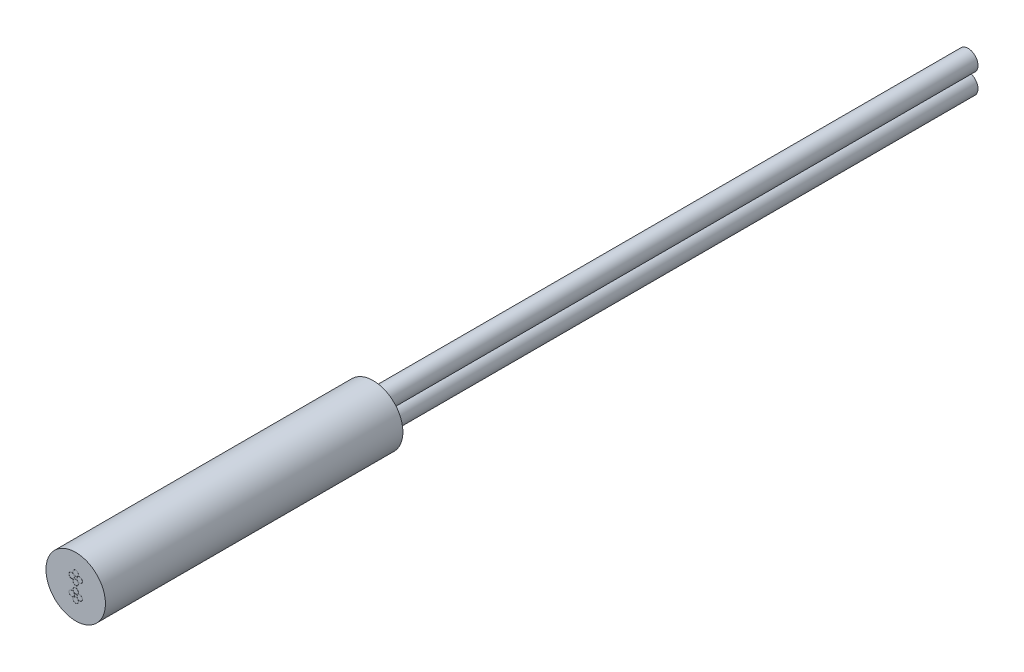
from build123d import *

# Parameters (mm, degrees)
SKETCH_1_R          = 1.5
EXTRUDE_1_DEPTH     = 15
SKETCH_3_R          = 0.5
EXTRUDE_2_DEPTH     = 30
SKETCH_2_R          = 0.1375
SKETCH_2_R_2        = 0.1325
CUT_EXTRUDE_1_DEPTH = 0.1


with BuildPart() as part:
    # Sketch 1 → Extrude 1 (new body)
    with BuildSketch(Plane.XY):
        Circle(SKETCH_1_R)
    extrude(amount=-EXTRUDE_1_DEPTH)

    # Sketch 3 → Extrude 2 (add)
    with BuildSketch(Plane(origin=(0, 0, -15), x_dir=(-1, 0, 0), z_dir=(0, 0, -1))):
        with Locations(Location((0, 0.51, 0), (0, 0, 180))):
            Circle(SKETCH_3_R)
        with Locations(Location((0, -0.51, 0), (0, 0, 180))):
            Circle(SKETCH_3_R)
    extrude(amount=EXTRUDE_2_DEPTH)

    # Sketch 2 → Cut-Extrude 1 (cut)
    # profile 1 of 8: a face of its own
    with BuildSketch(Plane.XY):
        with Locations((0, 0.590550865)):
            Circle(SKETCH_2_R)
        with Locations((0, 0.590550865)):
            Circle(SKETCH_2_R_2, mode=Mode.SUBTRACT)
    # profile 2 of 8: a face of its own
    with BuildSketch(Plane.XY):
        with Locations((-0.201525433, 0.389025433)):
            Circle(SKETCH_2_R)
        with Locations((-0.201525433, 0.389025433)):
            Circle(SKETCH_2_R_2, mode=Mode.SUBTRACT)
    # profile 3 of 8: a face of its own
    with BuildSketch(Plane.XY):
        with Locations((0.201525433, 0.389025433)):
            Circle(SKETCH_2_R)
        with Locations((0.201525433, 0.389025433)):
            Circle(SKETCH_2_R_2, mode=Mode.SUBTRACT)
    # profile 4 of 8: a face of its own
    with BuildSketch(Plane.XY):
        with Locations((0, 0.1875)):
            Circle(SKETCH_2_R)
        with Locations((0, 0.1875)):
            Circle(SKETCH_2_R_2, mode=Mode.SUBTRACT)
    # profile 5 of 8: a face of its own
    with BuildSketch(Plane.XY):
        with Locations(Location((-0.201525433, -0.389025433, 0), (0, 0, 180))):
            Circle(SKETCH_2_R)
        with Locations(Location((-0.201525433, -0.389025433, 0), (0, 0, 180))):
            Circle(SKETCH_2_R_2, mode=Mode.SUBTRACT)
    # profile 6 of 8: a face of its own
    with BuildSketch(Plane.XY):
        with Locations(Location((0, -0.1875, 0), (0, 0, 180))):
            Circle(SKETCH_2_R)
        with Locations(Location((0, -0.1875, 0), (0, 0, 180))):
            Circle(SKETCH_2_R_2, mode=Mode.SUBTRACT)
    # profile 7 of 8: a face of its own
    with BuildSketch(Plane.XY):
        with Locations(Location((0.201525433, -0.389025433, 0), (0, 0, 180))):
            Circle(SKETCH_2_R)
        with Locations(Location((0.201525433, -0.389025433, 0), (0, 0, 180))):
            Circle(SKETCH_2_R_2, mode=Mode.SUBTRACT)
    # profile 8 of 8: a face of its own
    with BuildSketch(Plane.XY):
        with Locations(Location((0, -0.590550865, 0), (0, 0, 180))):
            Circle(SKETCH_2_R)
        with Locations(Location((0, -0.590550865, 0), (0, 0, 180))):
            Circle(SKETCH_2_R_2, mode=Mode.SUBTRACT)
    extrude(amount=-CUT_EXTRUDE_1_DEPTH, mode=Mode.SUBTRACT)


solid = part.part
